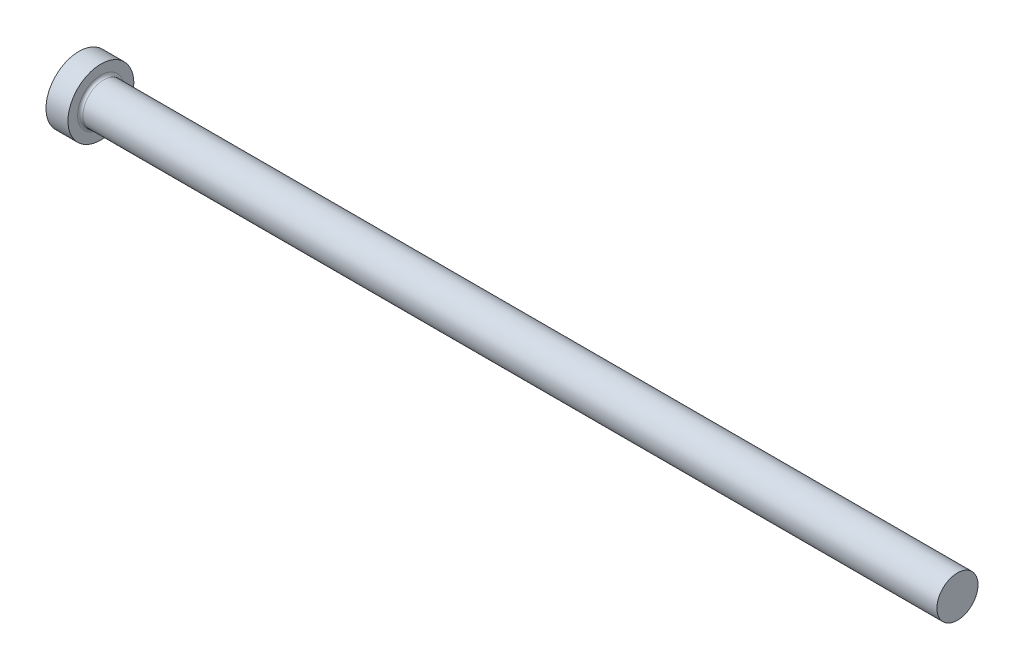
from build123d import *


with BuildPart() as part:
    # Sketch1 → PIN (revolve)
    with BuildSketch(Plane.XY, mode=Mode.PRIVATE) as pin_sk:
        with BuildLine():
            Line((0, 0), (0, 9.525))
            Line((0, 9.525), (6.35, 9.525))
            Line((6.35, 9.525), (6.35, 6.73481))
            ThreePointArc((6.35, 6.73481), (6.58062412, 6.17803412), (7.1374, 5.94741))
            Line((7.1374, 5.94741), (254, 5.94741))
            Line((254, 5.94741), (254, 0))
            Line((254, 0), (0, 0))
        make_face()
    revolve(pin_sk.sketch.rotate(Axis((254, 0, 0), (-1, 0, 0)), 180), axis=Axis((254, 0, 0), (-1, 0, 0)))


solid = part.part
